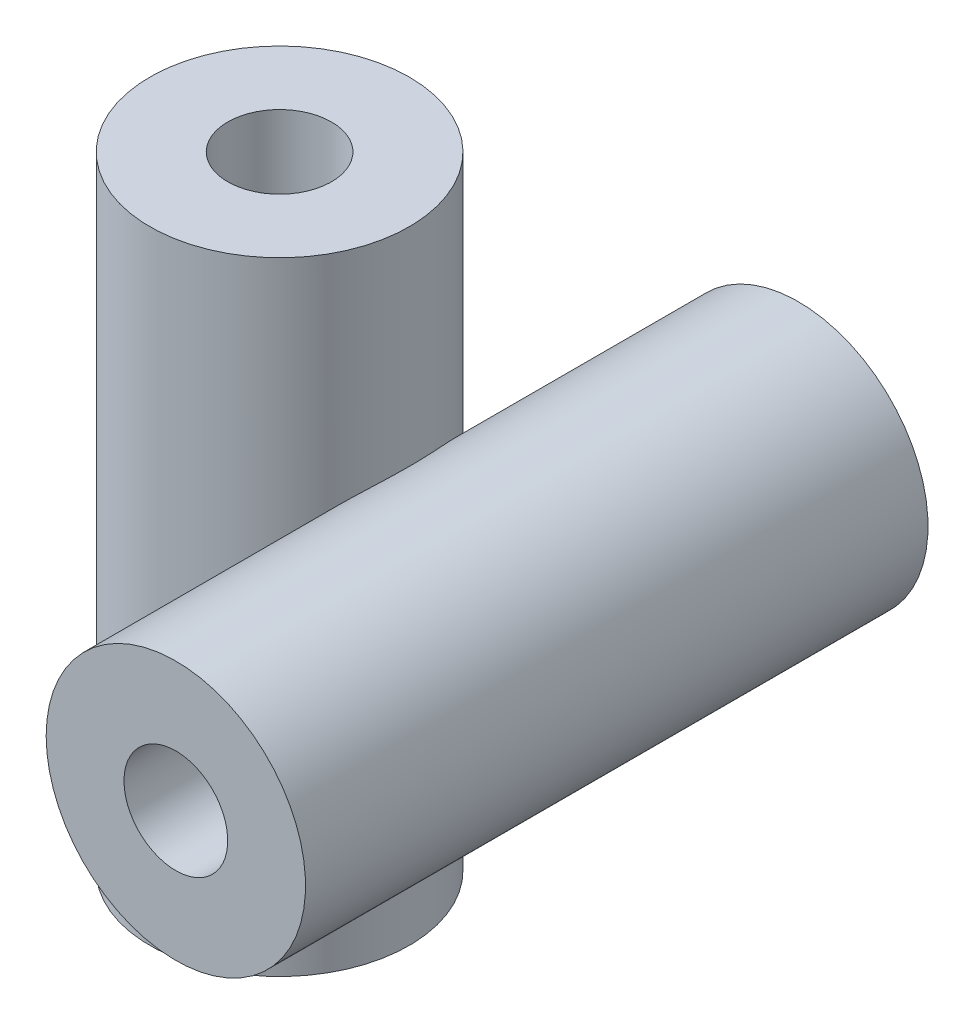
from build123d import *

# Parameters (mm, degrees)
SKETCH1_W                = 6.25
SKETCH1_H                = 30
SKETCH2_W                = 6.25
SKETCH2_H                = 30
F_5_0_5_DIAMETER_HOLE1_D = 5
F_5_0_5_DIAMETER_HOLE2_D = 5


with BuildPart() as part:
    # Sketch1 → Revolve1 (revolve)
    with BuildSketch(Plane.XZ, mode=Mode.PRIVATE) as revolve1_sk:
        with Locations((18.125000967, -3.22e-07)):
            Rectangle(SKETCH1_W, SKETCH1_H)
    revolve(revolve1_sk.sketch.rotate(Axis((15.000000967, 0, 15.002108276), (0, 0, -1)), 180), axis=Axis((15.000000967, 0, 15.002108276), (0, 0, -1)))

    # Sketch2 → Revolve2 (revolve)
    with BuildSketch(Plane(origin=(5.000000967, 0, 0), x_dir=(0, 0, -1), z_dir=(1, 0, 0))):
        with Locations((3.125000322, -1.525e-06)):
            Rectangle(SKETCH2_W, SKETCH2_H)
    revolve(axis=Axis((5.000000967, 14.999998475, -3.22e-07), (0, -1, 0)))

    # 5.0 _5_ Diameter Hole1 (through all)
    with Locations(Plane(origin=(0, -15.000001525, 0), x_dir=(-1, 0, 0), z_dir=(0, -1, 0))):
        with Locations((-5.000000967, 3.22e-07)):
            Hole(F_5_0_5_DIAMETER_HOLE1_D / 2)

    # 5.0 _5_ Diameter Hole2 (through all)
    with Locations(Plane(origin=(0, 0, -15.000000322), x_dir=(-1, 0, 0), z_dir=(0, 0, -1))):
        with Locations((-15.000000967, -1.525e-06)):
            Hole(F_5_0_5_DIAMETER_HOLE2_D / 2)


solid = part.part
